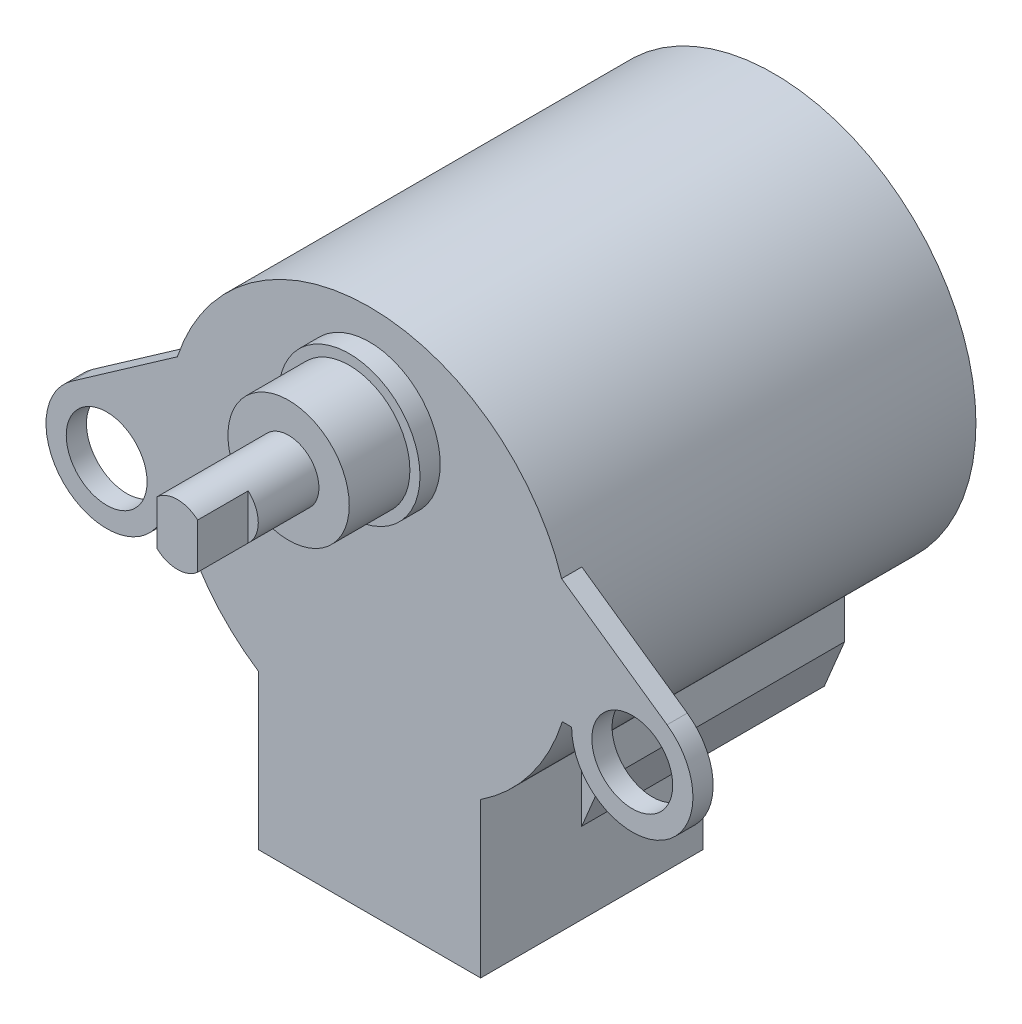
from build123d import *

# Parameters (mm, degrees)
ESQUISSE1_R             = 10
EXTRUSION1_DEPTH        = 20
EXTRUSION2_DEPTH        = 11
EXTRUSION3_START        = -12
EXTRUSION3_DEPTH        = 12
EXTRUSION4_DEPTH        = 1
ENL_V_MAT_EXTRU_1_REACH = 32.199
ESQUISSE6_R             = 2
ESQUISSE7_R             = 3.5
EXTRUSION5_DEPTH        = 1
ESQUISSE8_R             = 3
EXTRUSION6_DEPTH        = 3
ESQUISSE9_R             = 1.5
EXTRUSION7_DEPTH        = 5.5
ENL_V_START             = -2.5
ENL_V_MAT_EXTRU_2_DEPTH = 2.5


with BuildPart() as part:
    # Esquisse1 → Extrusion1 (new body)
    with BuildSketch(Plane.XY):
        Circle(ESQUISSE1_R)
    extrude(amount=-EXTRUSION1_DEPTH)

    # Esquisse2 → Extrusion2 (add)
    with BuildSketch(Plane.XY):
        with BuildLine():
            Line((-5.5, -8.351646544), (-5.5, -16))
            Line((-5.5, -16), (5.5, -16))
            Line((5.5, -16), (5.5, -8.351646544))
            ThreePointArc((5.5, -8.351646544), (0, -10), (-5.5, -8.351646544))
        make_face()
    extrude(amount=-EXTRUSION2_DEPTH)

    # Esquisse4 → Extrusion3 (add)
    with BuildSketch(Plane(origin=(0, 0, -17), x_dir=(-1, 0, 0), z_dir=(0, 0, -1)).offset(EXTRUSION3_START)):
        with BuildLine():
            Line((6.5, -9.599342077), (6.5, -7.599342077))
            ThreePointArc((6.5, -7.599342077), (0, -10), (-6.5, -7.599342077))
            Line((-6.5, -7.599342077), (-6.5, -9.599342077))
            Line((-6.5, -9.599342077), (-5.5, -12))
            Line((-5.5, -12), (5.5, -12))
            Line((5.5, -12), (6.5, -9.599342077))
        make_face()
    extrude(amount=EXTRUSION3_DEPTH)

    # Esquisse5 → Extrusion4 (add)
    with BuildSketch(Plane.XY):
        with BuildLine():
            Line((14.720729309, -0.542543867), (9.504022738, 3.110233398))
            ThreePointArc((9.504022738, 3.110233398), (9.999832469, 0.057884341), (9.539392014, -3))
            Line((9.539392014, -3), (10, -3))
            ThreePointArc((10, -3), (14.38524584, -5.6610325), (14.720729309, -0.542543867))
        make_face()
    extrusion4 = extrude(amount=-EXTRUSION4_DEPTH)

    # Esquisse6 → Enl_v. mat.-Extru.1 (cut, up to next)
    with BuildSketch(Plane.XY, mode=Mode.PRIVATE) as enl_v_mat_extru_1_sk1:
        with Locations((13, -3)):
            Circle(ESQUISSE6_R)
    enl_v_mat_extru_1_tool1 = extrude(enl_v_mat_extru_1_sk1.sketch, amount=-ENL_V_MAT_EXTRU_1_REACH, mode=Mode.PRIVATE) & part.part
    enl_v_mat_extru_1 = enl_v_mat_extru_1_tool1.solids().sort_by_distance((13, -3, 0))[0]
    add(enl_v_mat_extru_1, mode=Mode.SUBTRACT)

    # Sym_trie1: Extrusion4, Enl_v. mat.-Extru.1 across plane
    add(extrusion4.mirror(Plane(origin=(0, 0, 0), x_dir=(0, 0, 1), z_dir=(1, 0, 0))))
    add(enl_v_mat_extru_1.mirror(Plane(origin=(0, 0, 0), x_dir=(0, 0, 1), z_dir=(1, 0, 0))), mode=Mode.SUBTRACT)

    # Esquisse7 → Extrusion5 (add)
    with BuildSketch(Plane.XY):
        with Locations((0, 5)):
            Circle(ESQUISSE7_R)
    extrude(amount=EXTRUSION5_DEPTH)

    # Esquisse8 → Extrusion6 (add)
    with BuildSketch(Plane.XY.offset(1)):
        with Locations((0, 5)):
            Circle(ESQUISSE8_R)
    extrude(amount=EXTRUSION6_DEPTH)

    # Esquisse9 → Extrusion7 (add)
    with BuildSketch(Plane.XY.offset(4)):
        with Locations((0, 5)):
            Circle(ESQUISSE9_R)
    extrude(amount=EXTRUSION7_DEPTH)

    # Esquisse10 → Enl_v. mat.-Extru.2 (cut)
    with BuildSketch(Plane.XY.offset(9.5).offset(ENL_V_START)):
        with BuildLine():
            Line((1, 6.118033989), (1, 3.881966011))
            ThreePointArc((1, 3.881966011), (1.5, 5), (1, 6.118033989))
        make_face()
        with BuildLine():
            Line((-1, 6.118033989), (-1, 3.881966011))
            ThreePointArc((-1, 3.881966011), (-1.5, 5), (-1, 6.118033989))
        make_face()
    extrude(amount=ENL_V_MAT_EXTRU_2_DEPTH, mode=Mode.SUBTRACT)


solid = part.part
